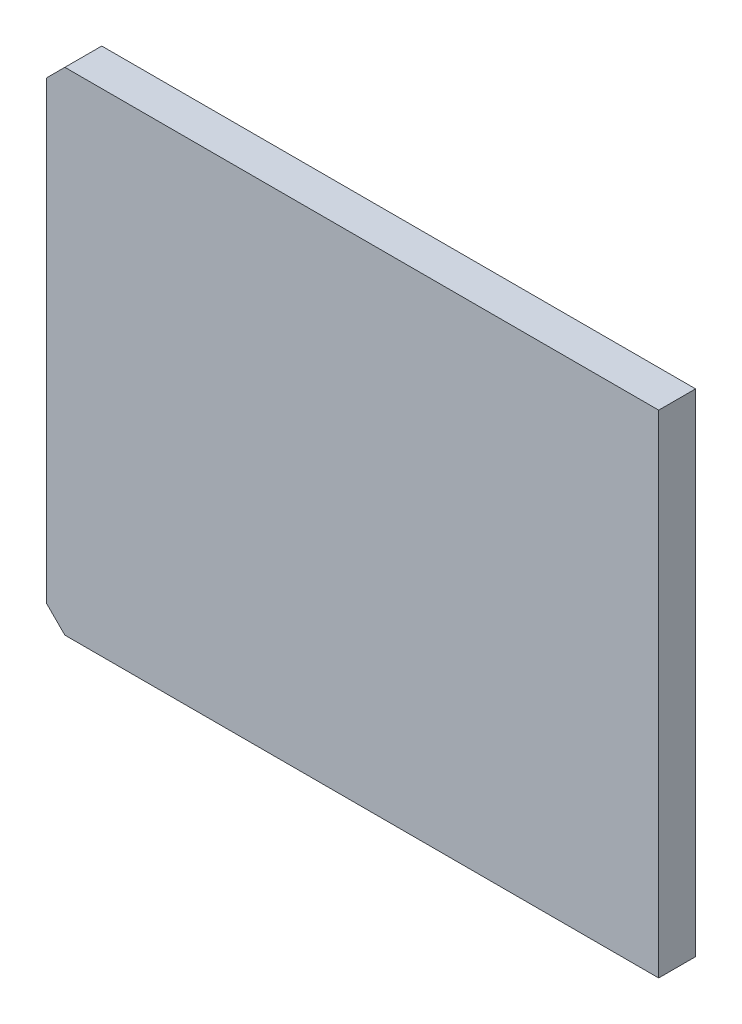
ISO-10303-21;
HEADER;
FILE_DESCRIPTION(('STEP AP214'),'2;1');
FILE_NAME('part.step','',(''),(''),'','','');
FILE_SCHEMA(('AUTOMOTIVE_DESIGN { 1 0 10303 214 1 1 1 1 }'));
ENDSEC;
DATA;
#1=APPLICATION_CONTEXT('core data for automotive mechanical design processes');
#2=APPLICATION_PROTOCOL_DEFINITION('international standard','automotive_design',2000,#1);
#3=PRODUCT_CONTEXT('',#1,'mechanical');
#4=PRODUCT('Part','Part','',(#3));
#5=PRODUCT_RELATED_PRODUCT_CATEGORY('part','',(#4));
#6=PRODUCT_DEFINITION_FORMATION('','',#4);
#7=PRODUCT_DEFINITION_CONTEXT('part definition',#1,'design');
#8=PRODUCT_DEFINITION('design','',#6,#7);
#9=PRODUCT_DEFINITION_SHAPE('','',#8);
#10=(LENGTH_UNIT() NAMED_UNIT(*) SI_UNIT(.MILLI.,.METRE.));
#11=(NAMED_UNIT(*) PLANE_ANGLE_UNIT() SI_UNIT($,.RADIAN.));
#12=(NAMED_UNIT(*) SI_UNIT($,.STERADIAN.) SOLID_ANGLE_UNIT());
#13=UNCERTAINTY_MEASURE_WITH_UNIT(LENGTH_MEASURE(1.E-05),#10,'distance_accuracy_value','');
#14=(GEOMETRIC_REPRESENTATION_CONTEXT(3) GLOBAL_UNCERTAINTY_ASSIGNED_CONTEXT((#13)) GLOBAL_UNIT_ASSIGNED_CONTEXT((#10,
#11,#12)) REPRESENTATION_CONTEXT('',''));
#15=CARTESIAN_POINT('',(0.,0.,0.));
#16=DIRECTION('',(0.,0.,1.));
#17=DIRECTION('',(1.,0.,0.));
#18=AXIS2_PLACEMENT_3D('',#15,#16,#17);
#19=CARTESIAN_POINT('',(24.9,20.,3.));
#20=DIRECTION('',(-1.,0.,0.));
#21=DIRECTION('',(0.,-1.,0.));
#22=AXIS2_PLACEMENT_3D('',#19,#20,#21);
#23=PLANE('',#22);
#24=DIRECTION('',(0.,1.,0.));
#25=VECTOR('',#24,1.);
#26=CARTESIAN_POINT('',(24.9,20.,0.));
#27=LINE('',#26,#25);
#28=CARTESIAN_POINT('',(24.9,-20.,0.));
#29=VERTEX_POINT('',#28);
#30=CARTESIAN_POINT('',(24.9,20.,0.));
#31=VERTEX_POINT('',#30);
#32=EDGE_CURVE('E106',#29,#31,#27,.T.);
#33=ORIENTED_EDGE('',*,*,#32,.T.);
#34=DIRECTION('',(0.,0.,-1.));
#35=VECTOR('',#34,1.);
#36=CARTESIAN_POINT('',(24.9,20.,3.));
#37=LINE('',#36,#35);
#38=CARTESIAN_POINT('',(24.9,20.,3.));
#39=VERTEX_POINT('',#38);
#40=EDGE_CURVE('E89',#39,#31,#37,.T.);
#41=ORIENTED_EDGE('',*,*,#40,.F.);
#42=DIRECTION('',(0.,1.,0.));
#43=VECTOR('',#42,1.);
#44=CARTESIAN_POINT('',(24.9,20.,3.));
#45=LINE('',#44,#43);
#46=CARTESIAN_POINT('',(24.9,-20.,3.));
#47=VERTEX_POINT('',#46);
#48=EDGE_CURVE('E94',#47,#39,#45,.T.);
#49=ORIENTED_EDGE('',*,*,#48,.F.);
#50=DIRECTION('',(0.,0.,-1.));
#51=VECTOR('',#50,1.);
#52=CARTESIAN_POINT('',(24.9,-20.,3.));
#53=LINE('',#52,#51);
#54=EDGE_CURVE('E108',#47,#29,#53,.T.);
#55=ORIENTED_EDGE('',*,*,#54,.T.);
#56=EDGE_LOOP('',(#33,#41,#49,#55));
#57=FACE_BOUND('',#56,.T.);
#58=ADVANCED_FACE('F33',(#57),#23,.F.);
#59=CARTESIAN_POINT('',(-24.9,20.,3.));
#60=DIRECTION('',(0.,-1.,0.));
#61=DIRECTION('',(0.,0.,-1.));
#62=AXIS2_PLACEMENT_3D('',#59,#60,#61);
#63=PLANE('',#62);
#64=DIRECTION('',(-1.,0.,0.));
#65=VECTOR('',#64,1.);
#66=CARTESIAN_POINT('',(-24.9,20.,0.));
#67=LINE('',#66,#65);
#68=CARTESIAN_POINT('',(-23.4,20.,0.));
#69=VERTEX_POINT('',#68);
#70=EDGE_CURVE('E138',#31,#69,#67,.T.);
#71=ORIENTED_EDGE('',*,*,#70,.T.);
#72=DIRECTION('',(0.,0.,1.));
#73=VECTOR('',#72,1.);
#74=CARTESIAN_POINT('',(-23.4,20.,3.));
#75=LINE('',#74,#73);
#76=CARTESIAN_POINT('',(-23.4,20.,3.));
#77=VERTEX_POINT('',#76);
#78=EDGE_CURVE('E11',#69,#77,#75,.T.);
#79=ORIENTED_EDGE('',*,*,#78,.T.);
#80=DIRECTION('',(-1.,0.,0.));
#81=VECTOR('',#80,1.);
#82=CARTESIAN_POINT('',(-24.9,20.,3.));
#83=LINE('',#82,#81);
#84=EDGE_CURVE('E85',#39,#77,#83,.T.);
#85=ORIENTED_EDGE('',*,*,#84,.F.);
#86=ORIENTED_EDGE('',*,*,#40,.T.);
#87=EDGE_LOOP('',(#71,#79,#85,#86));
#88=FACE_BOUND('',#87,.T.);
#89=ADVANCED_FACE('F87',(#88),#63,.F.);
#90=CARTESIAN_POINT('',(-24.9,20.,3.));
#91=DIRECTION('',(1.,0.,0.));
#92=DIRECTION('',(0.,1.,0.));
#93=AXIS2_PLACEMENT_3D('',#90,#91,#92);
#94=PLANE('',#93);
#95=DIRECTION('',(0.,-1.,0.));
#96=VECTOR('',#95,1.);
#97=CARTESIAN_POINT('',(-24.9,20.,0.));
#98=LINE('',#97,#96);
#99=CARTESIAN_POINT('',(-24.9,18.5,0.));
#100=VERTEX_POINT('',#99);
#101=CARTESIAN_POINT('',(-24.9,-18.5,0.));
#102=VERTEX_POINT('',#101);
#103=EDGE_CURVE('E135',#100,#102,#98,.T.);
#104=ORIENTED_EDGE('',*,*,#103,.T.);
#105=DIRECTION('',(0.,0.,1.));
#106=VECTOR('',#105,1.);
#107=CARTESIAN_POINT('',(-24.9,-18.5,3.));
#108=LINE('',#107,#106);
#109=CARTESIAN_POINT('',(-24.9,-18.5,3.));
#110=VERTEX_POINT('',#109);
#111=EDGE_CURVE('E54',#102,#110,#108,.T.);
#112=ORIENTED_EDGE('',*,*,#111,.T.);
#113=DIRECTION('',(0.,-1.,0.));
#114=VECTOR('',#113,1.);
#115=CARTESIAN_POINT('',(-24.9,20.,3.));
#116=LINE('',#115,#114);
#117=CARTESIAN_POINT('',(-24.9,18.5,3.));
#118=VERTEX_POINT('',#117);
#119=EDGE_CURVE('E93',#118,#110,#116,.T.);
#120=ORIENTED_EDGE('',*,*,#119,.F.);
#121=DIRECTION('',(0.,0.,-1.));
#122=VECTOR('',#121,1.);
#123=CARTESIAN_POINT('',(-24.9,18.5,3.));
#124=LINE('',#123,#122);
#125=EDGE_CURVE('E119',#118,#100,#124,.T.);
#126=ORIENTED_EDGE('',*,*,#125,.T.);
#127=EDGE_LOOP('',(#104,#112,#120,#126));
#128=FACE_BOUND('',#127,.T.);
#129=ADVANCED_FACE('F136',(#128),#94,.F.);
#130=CARTESIAN_POINT('',(-24.9,-20.,3.));
#131=DIRECTION('',(0.,1.,0.));
#132=DIRECTION('',(0.,0.,1.));
#133=AXIS2_PLACEMENT_3D('',#130,#131,#132);
#134=PLANE('',#133);
#135=DIRECTION('',(1.,0.,0.));
#136=VECTOR('',#135,1.);
#137=CARTESIAN_POINT('',(-24.9,-20.,3.));
#138=LINE('',#137,#136);
#139=CARTESIAN_POINT('',(-23.4,-20.,3.));
#140=VERTEX_POINT('',#139);
#141=EDGE_CURVE('E99',#140,#47,#138,.T.);
#142=ORIENTED_EDGE('',*,*,#141,.F.);
#143=DIRECTION('',(0.,0.,-1.));
#144=VECTOR('',#143,1.);
#145=CARTESIAN_POINT('',(-23.4,-20.,3.));
#146=LINE('',#145,#144);
#147=CARTESIAN_POINT('',(-23.4,-20.,0.));
#148=VERTEX_POINT('',#147);
#149=EDGE_CURVE('E107',#140,#148,#146,.T.);
#150=ORIENTED_EDGE('',*,*,#149,.T.);
#151=DIRECTION('',(1.,0.,0.));
#152=VECTOR('',#151,1.);
#153=CARTESIAN_POINT('',(-24.9,-20.,0.));
#154=LINE('',#153,#152);
#155=EDGE_CURVE('E103',#148,#29,#154,.T.);
#156=ORIENTED_EDGE('',*,*,#155,.T.);
#157=ORIENTED_EDGE('',*,*,#54,.F.);
#158=EDGE_LOOP('',(#142,#150,#156,#157));
#159=FACE_BOUND('',#158,.T.);
#160=ADVANCED_FACE('F128',(#159),#134,.F.);
#161=CARTESIAN_POINT('',(0.,0.,3.));
#162=DIRECTION('',(0.,0.,1.));
#163=DIRECTION('',(1.,0.,0.));
#164=AXIS2_PLACEMENT_3D('',#161,#162,#163);
#165=PLANE('',#164);
#166=ORIENTED_EDGE('',*,*,#119,.T.);
#167=DIRECTION('',(-0.707106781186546,0.707106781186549,0.));
#168=VECTOR('',#167,1.);
#169=CARTESIAN_POINT('',(-21.7000000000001,-21.7,3.));
#170=LINE('',#169,#168);
#171=EDGE_CURVE('E41',#110,#140,#170,.F.);
#172=ORIENTED_EDGE('',*,*,#171,.T.);
#173=ORIENTED_EDGE('',*,*,#141,.T.);
#174=ORIENTED_EDGE('',*,*,#48,.T.);
#175=ORIENTED_EDGE('',*,*,#84,.T.);
#176=DIRECTION('',(0.707106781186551,0.707106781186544,0.));
#177=VECTOR('',#176,1.);
#178=CARTESIAN_POINT('',(-21.6999999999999,21.7000000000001,3.));
#179=LINE('',#178,#177);
#180=EDGE_CURVE('E123',#77,#118,#179,.F.);
#181=ORIENTED_EDGE('',*,*,#180,.T.);
#182=EDGE_LOOP('',(#166,#172,#173,#174,#175,#181));
#183=FACE_BOUND('',#182,.T.);
#184=ADVANCED_FACE('F97',(#183),#165,.T.);
#185=CARTESIAN_POINT('',(0.,0.,0.));
#186=DIRECTION('',(0.,0.,1.));
#187=DIRECTION('',(1.,0.,0.));
#188=AXIS2_PLACEMENT_3D('',#185,#186,#187);
#189=PLANE('',#188);
#190=ORIENTED_EDGE('',*,*,#155,.F.);
#191=DIRECTION('',(0.707106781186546,-0.707106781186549,0.));
#192=VECTOR('',#191,1.);
#193=CARTESIAN_POINT('',(-23.4,-20.,0.));
#194=LINE('',#193,#192);
#195=EDGE_CURVE('E117',#148,#102,#194,.F.);
#196=ORIENTED_EDGE('',*,*,#195,.T.);
#197=ORIENTED_EDGE('',*,*,#103,.F.);
#198=DIRECTION('',(-0.707106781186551,-0.707106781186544,0.));
#199=VECTOR('',#198,1.);
#200=CARTESIAN_POINT('',(-24.9,18.5,0.));
#201=LINE('',#200,#199);
#202=EDGE_CURVE('E111',#100,#69,#201,.F.);
#203=ORIENTED_EDGE('',*,*,#202,.T.);
#204=ORIENTED_EDGE('',*,*,#70,.F.);
#205=ORIENTED_EDGE('',*,*,#32,.F.);
#206=EDGE_LOOP('',(#190,#196,#197,#203,#204,#205));
#207=FACE_BOUND('',#206,.T.);
#208=ADVANCED_FACE('F134',(#207),#189,.F.);
#209=CARTESIAN_POINT('',(-23.4,-20.,3.));
#210=DIRECTION('',(0.707106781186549,0.707106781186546,0.));
#211=DIRECTION('',(0.,0.,-1.));
#212=AXIS2_PLACEMENT_3D('',#209,#210,#211);
#213=PLANE('',#212);
#214=ORIENTED_EDGE('',*,*,#171,.F.);
#215=ORIENTED_EDGE('',*,*,#111,.F.);
#216=ORIENTED_EDGE('',*,*,#195,.F.);
#217=ORIENTED_EDGE('',*,*,#149,.F.);
#218=EDGE_LOOP('',(#214,#215,#216,#217));
#219=FACE_BOUND('',#218,.T.);
#220=ADVANCED_FACE('F131',(#219),#213,.F.);
#221=CARTESIAN_POINT('',(-24.9,18.5,3.));
#222=DIRECTION('',(0.707106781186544,-0.707106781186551,0.));
#223=DIRECTION('',(0.,0.,-1.));
#224=AXIS2_PLACEMENT_3D('',#221,#222,#223);
#225=PLANE('',#224);
#226=ORIENTED_EDGE('',*,*,#180,.F.);
#227=ORIENTED_EDGE('',*,*,#78,.F.);
#228=ORIENTED_EDGE('',*,*,#202,.F.);
#229=ORIENTED_EDGE('',*,*,#125,.F.);
#230=EDGE_LOOP('',(#226,#227,#228,#229));
#231=FACE_BOUND('',#230,.T.);
#232=ADVANCED_FACE('F35',(#231),#225,.F.);
#233=CLOSED_SHELL('',(#58,#89,#129,#160,#184,#208,#220,#232));
#234=MANIFOLD_SOLID_BREP('B2',#233);
#235=ADVANCED_BREP_SHAPE_REPRESENTATION('',(#18,#234),#14);
#236=SHAPE_DEFINITION_REPRESENTATION(#9,#235);
ENDSEC;
END-ISO-10303-21;
